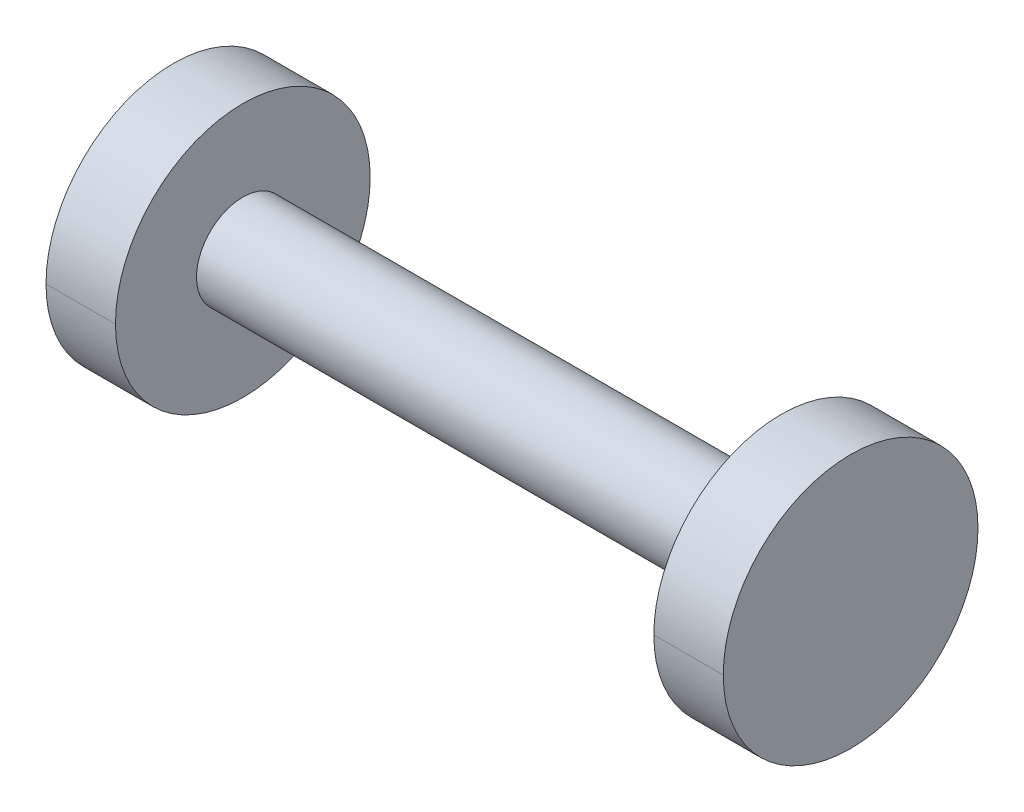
from build123d import *


with BuildPart() as part:
    # Esquisse1 → R_volution1 (revolve)
    with BuildSketch(Plane.XY):
        Polygon((0, 0), (0, 11), (-6, 11), (-6, 4), (-52.5, 4), (-52.5, 11), (-58.5, 11), (-58.5, 0), align=None)
    revolve(axis=Axis((-58.5, 0, 0), (-1, 0, 0)))


solid = part.part
